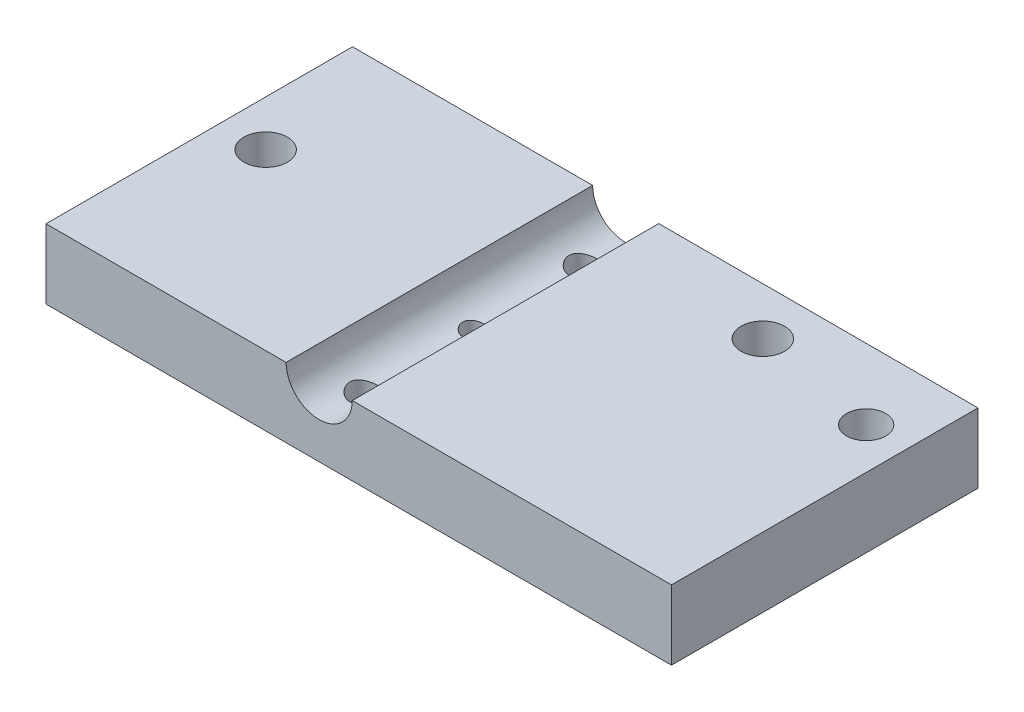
ISO-10303-21;
HEADER;
FILE_DESCRIPTION(('STEP AP214'),'2;1');
FILE_NAME('part.step','',(''),(''),'','','');
FILE_SCHEMA(('AUTOMOTIVE_DESIGN { 1 0 10303 214 1 1 1 1 }'));
ENDSEC;
DATA;
#1=APPLICATION_CONTEXT('core data for automotive mechanical design processes');
#2=APPLICATION_PROTOCOL_DEFINITION('international standard','automotive_design',2000,#1);
#3=PRODUCT_CONTEXT('',#1,'mechanical');
#4=PRODUCT('Part','Part','',(#3));
#5=PRODUCT_RELATED_PRODUCT_CATEGORY('part','',(#4));
#6=PRODUCT_DEFINITION_FORMATION('','',#4);
#7=PRODUCT_DEFINITION_CONTEXT('part definition',#1,'design');
#8=PRODUCT_DEFINITION('design','',#6,#7);
#9=PRODUCT_DEFINITION_SHAPE('','',#8);
#10=(LENGTH_UNIT() NAMED_UNIT(*) SI_UNIT(.MILLI.,.METRE.));
#11=(NAMED_UNIT(*) PLANE_ANGLE_UNIT() SI_UNIT($,.RADIAN.));
#12=(NAMED_UNIT(*) SI_UNIT($,.STERADIAN.) SOLID_ANGLE_UNIT());
#13=UNCERTAINTY_MEASURE_WITH_UNIT(LENGTH_MEASURE(1.E-05),#10,'distance_accuracy_value','');
#14=(GEOMETRIC_REPRESENTATION_CONTEXT(3) GLOBAL_UNCERTAINTY_ASSIGNED_CONTEXT((#13)) GLOBAL_UNIT_ASSIGNED_CONTEXT((#10,
#11,#12)) REPRESENTATION_CONTEXT('',''));
#15=CARTESIAN_POINT('',(0.,0.,0.));
#16=DIRECTION('',(0.,0.,1.));
#17=DIRECTION('',(1.,0.,0.));
#18=AXIS2_PLACEMENT_3D('',#15,#16,#17);
#19=CARTESIAN_POINT('',(-71.9,8.,70.47));
#20=DIRECTION('',(0.,-1.,0.));
#21=DIRECTION('',(0.,0.,-1.));
#22=AXIS2_PLACEMENT_3D('',#19,#20,#21);
#23=PLANE('',#22);
#24=CARTESIAN_POINT('',(33.4,8.,10.97));
#25=DIRECTION('',(0.,1.,0.));
#26=DIRECTION('',(0.,0.,1.));
#27=AXIS2_PLACEMENT_3D('',#24,#25,#26);
#28=CIRCLE('',#27,5.);
#29=CARTESIAN_POINT('',(33.4,8.,15.97));
#30=VERTEX_POINT('',#29);
#31=EDGE_CURVE('E191',#30,#30,#28,.T.);
#32=ORIENTED_EDGE('',*,*,#31,.F.);
#33=EDGE_LOOP('',(#32));
#34=FACE_BOUND('',#33,.T.);
#35=CARTESIAN_POINT('',(62.4,8.,16.21));
#36=DIRECTION('',(0.,1.,0.));
#37=DIRECTION('',(0.,0.,1.));
#38=AXIS2_PLACEMENT_3D('',#35,#36,#37);
#39=CIRCLE('',#38,4.5);
#40=CARTESIAN_POINT('',(62.4,8.,20.71));
#41=VERTEX_POINT('',#40);
#42=EDGE_CURVE('E194',#41,#41,#39,.T.);
#43=ORIENTED_EDGE('',*,*,#42,.F.);
#44=EDGE_LOOP('',(#43));
#45=FACE_BOUND('',#44,.T.);
#46=DIRECTION('',(-1.,0.,0.));
#47=VECTOR('',#46,1.);
#48=CARTESIAN_POINT('',(-71.9,8.,0.));
#49=LINE('',#48,#47);
#50=CARTESIAN_POINT('',(71.9,8.,0.));
#51=VERTEX_POINT('',#50);
#52=CARTESIAN_POINT('',(-1.49999999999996,8.,0.));
#53=VERTEX_POINT('',#52);
#54=EDGE_CURVE('E122',#51,#53,#49,.T.);
#55=ORIENTED_EDGE('',*,*,#54,.T.);
#56=DIRECTION('',(0.,0.,1.));
#57=VECTOR('',#56,1.);
#58=CARTESIAN_POINT('',(-1.49999999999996,8.,0.));
#59=LINE('',#58,#57);
#60=CARTESIAN_POINT('',(-1.49999999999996,8.,70.47));
#61=VERTEX_POINT('',#60);
#62=EDGE_CURVE('E55',#53,#61,#59,.T.);
#63=ORIENTED_EDGE('',*,*,#62,.T.);
#64=DIRECTION('',(-1.,0.,0.));
#65=VECTOR('',#64,1.);
#66=CARTESIAN_POINT('',(-71.9,8.,70.47));
#67=LINE('',#66,#65);
#68=CARTESIAN_POINT('',(71.9,8.,70.47));
#69=VERTEX_POINT('',#68);
#70=EDGE_CURVE('E91',#69,#61,#67,.T.);
#71=ORIENTED_EDGE('',*,*,#70,.F.);
#72=DIRECTION('',(0.,0.,-1.));
#73=VECTOR('',#72,1.);
#74=CARTESIAN_POINT('',(71.9,8.,70.47));
#75=LINE('',#74,#73);
#76=EDGE_CURVE('E11',#69,#51,#75,.T.);
#77=ORIENTED_EDGE('',*,*,#76,.T.);
#78=EDGE_LOOP('',(#55,#63,#71,#77));
#79=FACE_BOUND('',#78,.T.);
#80=ADVANCED_FACE('F34',(#34,#45,#79),#23,.F.);
#81=CARTESIAN_POINT('',(71.9,8.,70.47));
#82=DIRECTION('',(-1.,0.,0.));
#83=DIRECTION('',(0.,-1.,0.));
#84=AXIS2_PLACEMENT_3D('',#81,#82,#83);
#85=PLANE('',#84);
#86=DIRECTION('',(0.,1.,0.));
#87=VECTOR('',#86,1.);
#88=CARTESIAN_POINT('',(71.9,8.,0.));
#89=LINE('',#88,#87);
#90=CARTESIAN_POINT('',(71.9,-8.,0.));
#91=VERTEX_POINT('',#90);
#92=EDGE_CURVE('E123',#91,#51,#89,.T.);
#93=ORIENTED_EDGE('',*,*,#92,.T.);
#94=ORIENTED_EDGE('',*,*,#76,.F.);
#95=DIRECTION('',(0.,1.,0.));
#96=VECTOR('',#95,1.);
#97=CARTESIAN_POINT('',(71.9,8.,70.47));
#98=LINE('',#97,#96);
#99=CARTESIAN_POINT('',(71.9,-8.,70.47));
#100=VERTEX_POINT('',#99);
#101=EDGE_CURVE('E132',#100,#69,#98,.T.);
#102=ORIENTED_EDGE('',*,*,#101,.F.);
#103=DIRECTION('',(0.,0.,-1.));
#104=VECTOR('',#103,1.);
#105=CARTESIAN_POINT('',(71.9,-8.,70.47));
#106=LINE('',#105,#104);
#107=EDGE_CURVE('E133',#100,#91,#106,.T.);
#108=ORIENTED_EDGE('',*,*,#107,.T.);
#109=EDGE_LOOP('',(#93,#94,#102,#108));
#110=FACE_BOUND('',#109,.T.);
#111=ADVANCED_FACE('F36',(#110),#85,.F.);
#112=CARTESIAN_POINT('',(-61.4,8.,30.47));
#113=DIRECTION('',(0.,1.,0.));
#114=DIRECTION('',(0.,0.,1.));
#115=AXIS2_PLACEMENT_3D('',#112,#113,#114);
#116=CIRCLE('',#115,5.);
#117=CARTESIAN_POINT('',(-61.4,8.,35.47));
#118=VERTEX_POINT('',#117);
#119=EDGE_CURVE('E314',#118,#118,#116,.T.);
#120=ORIENTED_EDGE('',*,*,#119,.F.);
#121=EDGE_LOOP('',(#120));
#122=FACE_BOUND('',#121,.T.);
#123=CARTESIAN_POINT('',(-16.7,8.,70.47));
#124=VERTEX_POINT('',#123);
#125=CARTESIAN_POINT('',(-71.9,8.,70.47));
#126=VERTEX_POINT('',#125);
#127=EDGE_CURVE('E116',#124,#126,#67,.T.);
#128=ORIENTED_EDGE('',*,*,#127,.F.);
#129=DIRECTION('',(0.,0.,1.));
#130=VECTOR('',#129,1.);
#131=CARTESIAN_POINT('',(-16.7,8.,0.));
#132=LINE('',#131,#130);
#133=CARTESIAN_POINT('',(-16.7,8.,0.));
#134=VERTEX_POINT('',#133);
#135=EDGE_CURVE('E102',#124,#134,#132,.F.);
#136=ORIENTED_EDGE('',*,*,#135,.T.);
#137=CARTESIAN_POINT('',(-71.9,8.,0.));
#138=VERTEX_POINT('',#137);
#139=EDGE_CURVE('E114',#134,#138,#49,.T.);
#140=ORIENTED_EDGE('',*,*,#139,.T.);
#141=DIRECTION('',(0.,0.,-1.));
#142=VECTOR('',#141,1.);
#143=CARTESIAN_POINT('',(-71.9,8.,70.47));
#144=LINE('',#143,#142);
#145=EDGE_CURVE('E47',#126,#138,#144,.T.);
#146=ORIENTED_EDGE('',*,*,#145,.F.);
#147=EDGE_LOOP('',(#128,#136,#140,#146));
#148=FACE_BOUND('',#147,.T.);
#149=ADVANCED_FACE('F112',(#122,#148),#23,.F.);
#150=CARTESIAN_POINT('',(-71.9,8.,70.47));
#151=DIRECTION('',(1.,0.,0.));
#152=DIRECTION('',(0.,0.,-1.));
#153=AXIS2_PLACEMENT_3D('',#150,#151,#152);
#154=PLANE('',#153);
#155=DIRECTION('',(0.,-1.,0.));
#156=VECTOR('',#155,1.);
#157=CARTESIAN_POINT('',(-71.9,8.,0.));
#158=LINE('',#157,#156);
#159=CARTESIAN_POINT('',(-71.9,-8.,0.));
#160=VERTEX_POINT('',#159);
#161=EDGE_CURVE('E121',#138,#160,#158,.T.);
#162=ORIENTED_EDGE('',*,*,#161,.T.);
#163=DIRECTION('',(0.,0.,-1.));
#164=VECTOR('',#163,1.);
#165=CARTESIAN_POINT('',(-71.9,-8.,70.47));
#166=LINE('',#165,#164);
#167=CARTESIAN_POINT('',(-71.9,-8.,70.47));
#168=VERTEX_POINT('',#167);
#169=EDGE_CURVE('E135',#168,#160,#166,.T.);
#170=ORIENTED_EDGE('',*,*,#169,.F.);
#171=DIRECTION('',(0.,-1.,0.));
#172=VECTOR('',#171,1.);
#173=CARTESIAN_POINT('',(-71.9,8.,70.47));
#174=LINE('',#173,#172);
#175=EDGE_CURVE('E199',#126,#168,#174,.T.);
#176=ORIENTED_EDGE('',*,*,#175,.F.);
#177=ORIENTED_EDGE('',*,*,#145,.T.);
#178=EDGE_LOOP('',(#162,#170,#176,#177));
#179=FACE_BOUND('',#178,.T.);
#180=ADVANCED_FACE('F171',(#179),#154,.F.);
#181=CARTESIAN_POINT('',(-71.9,-8.,70.47));
#182=DIRECTION('',(0.,1.,0.));
#183=DIRECTION('',(0.,0.,1.));
#184=AXIS2_PLACEMENT_3D('',#181,#182,#183);
#185=PLANE('',#184);
#186=CARTESIAN_POINT('',(33.4,-8.,10.97));
#187=DIRECTION('',(0.,1.,0.));
#188=DIRECTION('',(0.,0.,1.));
#189=AXIS2_PLACEMENT_3D('',#186,#187,#188);
#190=CIRCLE('',#189,5.);
#191=CARTESIAN_POINT('',(33.4,-8.,15.97));
#192=VERTEX_POINT('',#191);
#193=EDGE_CURVE('E312',#192,#192,#190,.T.);
#194=ORIENTED_EDGE('',*,*,#193,.T.);
#195=EDGE_LOOP('',(#194));
#196=FACE_BOUND('',#195,.T.);
#197=CARTESIAN_POINT('',(-61.4,-8.,30.47));
#198=DIRECTION('',(0.,1.,0.));
#199=DIRECTION('',(0.,0.,1.));
#200=AXIS2_PLACEMENT_3D('',#197,#198,#199);
#201=CIRCLE('',#200,5.);
#202=CARTESIAN_POINT('',(-61.4,-8.,35.47));
#203=VERTEX_POINT('',#202);
#204=EDGE_CURVE('E317',#203,#203,#201,.T.);
#205=ORIENTED_EDGE('',*,*,#204,.T.);
#206=EDGE_LOOP('',(#205));
#207=FACE_BOUND('',#206,.T.);
#208=CARTESIAN_POINT('',(62.4,-8.,16.21));
#209=DIRECTION('',(0.,1.,0.));
#210=DIRECTION('',(0.,0.,1.));
#211=AXIS2_PLACEMENT_3D('',#208,#209,#210);
#212=CIRCLE('',#211,3.86576453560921);
#213=CARTESIAN_POINT('',(62.4,-8.,20.0757645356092));
#214=VERTEX_POINT('',#213);
#215=EDGE_CURVE('E323',#214,#214,#212,.T.);
#216=ORIENTED_EDGE('',*,*,#215,.T.);
#217=EDGE_LOOP('',(#216));
#218=FACE_BOUND('',#217,.T.);
#219=CARTESIAN_POINT('',(-9.09999999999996,-8.,34.97));
#220=DIRECTION('',(0.,1.,0.));
#221=DIRECTION('',(0.,0.,1.));
#222=AXIS2_PLACEMENT_3D('',#219,#220,#221);
#223=CIRCLE('',#222,2.5);
#224=CARTESIAN_POINT('',(-9.09999999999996,-8.,37.47));
#225=VERTEX_POINT('',#224);
#226=EDGE_CURVE('E326',#225,#225,#223,.T.);
#227=ORIENTED_EDGE('',*,*,#226,.T.);
#228=EDGE_LOOP('',(#227));
#229=FACE_BOUND('',#228,.T.);
#230=CARTESIAN_POINT('',(-9.09999999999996,-8.,9.77));
#231=DIRECTION('',(0.,-1.,0.));
#232=DIRECTION('',(0.,0.,-1.));
#233=AXIS2_PLACEMENT_3D('',#230,#231,#232);
#234=CIRCLE('',#233,3.25000000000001);
#235=CARTESIAN_POINT('',(-9.09999999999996,-8.,6.51999999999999));
#236=VERTEX_POINT('',#235);
#237=EDGE_CURVE('E206',#236,#236,#234,.T.);
#238=ORIENTED_EDGE('',*,*,#237,.F.);
#239=EDGE_LOOP('',(#238));
#240=FACE_BOUND('',#239,.T.);
#241=CARTESIAN_POINT('',(-9.09999999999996,-8.,60.17));
#242=DIRECTION('',(0.,-1.,0.));
#243=DIRECTION('',(0.,0.,-1.));
#244=AXIS2_PLACEMENT_3D('',#241,#242,#243);
#245=CIRCLE('',#244,3.25000000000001);
#246=CARTESIAN_POINT('',(-9.09999999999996,-8.,56.92));
#247=VERTEX_POINT('',#246);
#248=EDGE_CURVE('E126',#247,#247,#245,.T.);
#249=ORIENTED_EDGE('',*,*,#248,.F.);
#250=EDGE_LOOP('',(#249));
#251=FACE_BOUND('',#250,.T.);
#252=DIRECTION('',(1.,0.,0.));
#253=VECTOR('',#252,1.);
#254=CARTESIAN_POINT('',(-71.9,-8.,0.));
#255=LINE('',#254,#253);
#256=EDGE_CURVE('E85',#160,#91,#255,.T.);
#257=ORIENTED_EDGE('',*,*,#256,.T.);
#258=ORIENTED_EDGE('',*,*,#107,.F.);
#259=DIRECTION('',(1.,0.,0.));
#260=VECTOR('',#259,1.);
#261=CARTESIAN_POINT('',(-71.9,-8.,70.47));
#262=LINE('',#261,#260);
#263=EDGE_CURVE('E64',#168,#100,#262,.T.);
#264=ORIENTED_EDGE('',*,*,#263,.F.);
#265=ORIENTED_EDGE('',*,*,#169,.T.);
#266=EDGE_LOOP('',(#257,#258,#264,#265));
#267=FACE_BOUND('',#266,.T.);
#268=ADVANCED_FACE('F166',(#196,#207,#218,#229,#240,#251,#267),#185,.F.);
#269=CARTESIAN_POINT('',(0.,0.,70.47));
#270=DIRECTION('',(0.,0.,1.));
#271=DIRECTION('',(1.,0.,0.));
#272=AXIS2_PLACEMENT_3D('',#269,#270,#271);
#273=PLANE('',#272);
#274=CARTESIAN_POINT('',(-9.09999999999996,8.,70.47));
#275=DIRECTION('',(0.,0.,1.));
#276=DIRECTION('',(1.,0.,0.));
#277=AXIS2_PLACEMENT_3D('',#274,#275,#276);
#278=CIRCLE('',#277,7.6);
#279=EDGE_CURVE('E108',#124,#61,#278,.T.);
#280=ORIENTED_EDGE('',*,*,#279,.F.);
#281=ORIENTED_EDGE('',*,*,#127,.T.);
#282=ORIENTED_EDGE('',*,*,#175,.T.);
#283=ORIENTED_EDGE('',*,*,#263,.T.);
#284=ORIENTED_EDGE('',*,*,#101,.T.);
#285=ORIENTED_EDGE('',*,*,#70,.T.);
#286=EDGE_LOOP('',(#280,#281,#282,#283,#284,#285));
#287=FACE_BOUND('',#286,.T.);
#288=ADVANCED_FACE('F163',(#287),#273,.T.);
#289=CARTESIAN_POINT('',(0.,0.,0.));
#290=DIRECTION('',(0.,0.,1.));
#291=DIRECTION('',(1.,0.,0.));
#292=AXIS2_PLACEMENT_3D('',#289,#290,#291);
#293=PLANE('',#292);
#294=ORIENTED_EDGE('',*,*,#139,.F.);
#295=CARTESIAN_POINT('',(-9.09999999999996,8.,0.));
#296=DIRECTION('',(0.,0.,1.));
#297=DIRECTION('',(1.,0.,0.));
#298=AXIS2_PLACEMENT_3D('',#295,#296,#297);
#299=CIRCLE('',#298,7.6);
#300=EDGE_CURVE('E99',#134,#53,#299,.T.);
#301=ORIENTED_EDGE('',*,*,#300,.T.);
#302=ORIENTED_EDGE('',*,*,#54,.F.);
#303=ORIENTED_EDGE('',*,*,#92,.F.);
#304=ORIENTED_EDGE('',*,*,#256,.F.);
#305=ORIENTED_EDGE('',*,*,#161,.F.);
#306=EDGE_LOOP('',(#294,#301,#302,#303,#304,#305));
#307=FACE_BOUND('',#306,.T.);
#308=ADVANCED_FACE('F120',(#307),#293,.F.);
#309=CARTESIAN_POINT('',(-9.09999999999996,8.,60.17));
#310=DIRECTION('',(0.,-1.,0.));
#311=DIRECTION('',(0.,0.,-1.));
#312=AXIS2_PLACEMENT_3D('',#309,#310,#311);
#313=CYLINDRICAL_SURFACE('',#312,3.25000000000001);
#314=CARTESIAN_POINT('',(-9.09999999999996,0.400000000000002,56.92));
#315=CARTESIAN_POINT('',(-9.18688160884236,0.400000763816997,56.9200010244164));
#316=CARTESIAN_POINT('',(-9.27379384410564,0.401495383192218,56.9234909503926));
#317=CARTESIAN_POINT('',(-9.44697556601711,0.407428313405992,56.9374042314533));
#318=CARTESIAN_POINT('',(-9.5332446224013,0.411868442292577,56.9478318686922));
#319=CARTESIAN_POINT('',(-9.79044511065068,0.429484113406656,56.9894489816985));
#320=CARTESIAN_POINT('',(-9.95954466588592,0.446954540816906,57.0309723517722));
#321=CARTESIAN_POINT('',(-10.2871235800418,0.491466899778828,57.1396558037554));
#322=CARTESIAN_POINT('',(-10.4456374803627,0.518475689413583,57.2067271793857));
#323=CARTESIAN_POINT('',(-10.7490404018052,0.579447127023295,57.3642257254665));
#324=CARTESIAN_POINT('',(-10.8939331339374,0.613407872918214,57.4546465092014));
#325=CARTESIAN_POINT('',(-11.1737494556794,0.686895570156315,57.6612652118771));
#326=CARTESIAN_POINT('',(-11.3078650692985,0.726611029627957,57.778488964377));
#327=CARTESIAN_POINT('',(-11.5552374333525,0.80634106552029,58.0332138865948));
#328=CARTESIAN_POINT('',(-11.6684826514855,0.84635579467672,58.1707261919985));
#329=CARTESIAN_POINT('',(-11.8767787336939,0.924511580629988,58.470859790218));
#330=CARTESIAN_POINT('',(-11.9705633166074,0.962444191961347,58.6344199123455));
#331=CARTESIAN_POINT('',(-12.1289290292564,1.02913012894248,58.9768459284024));
#332=CARTESIAN_POINT('',(-12.1935259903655,1.0578884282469,59.155703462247));
#333=CARTESIAN_POINT('',(-12.288303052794,1.10091842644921,59.5143517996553));
#334=CARTESIAN_POINT('',(-12.3200415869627,1.1158421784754,59.6936494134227));
#335=CARTESIAN_POINT('',(-12.3530575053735,1.13137671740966,60.0555983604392));
#336=CARTESIAN_POINT('',(-12.3543530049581,1.13199601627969,60.2382476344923));
#337=CARTESIAN_POINT('',(-12.3276152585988,1.11940049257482,60.5857978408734));
#338=CARTESIAN_POINT('',(-12.3019656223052,1.10730994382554,60.7509312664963));
#339=CARTESIAN_POINT('',(-12.2260800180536,1.07256565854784,61.0742752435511));
#340=CARTESIAN_POINT('',(-12.175839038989,1.04990976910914,61.2324843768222));
#341=CARTESIAN_POINT('',(-12.0512076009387,0.996068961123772,61.5415908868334));
#342=CARTESIAN_POINT('',(-11.9763148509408,0.96470897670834,61.6922538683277));
#343=CARTESIAN_POINT('',(-11.8048630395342,0.897028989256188,61.979480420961));
#344=CARTESIAN_POINT('',(-11.7082951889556,0.860706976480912,62.1160382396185));
#345=CARTESIAN_POINT('',(-11.4860999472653,0.783245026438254,62.3840384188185));
#346=CARTESIAN_POINT('',(-11.3586456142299,0.741964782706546,62.5139299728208));
#347=CARTESIAN_POINT('',(-11.0833767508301,0.661965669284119,62.7510315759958));
#348=CARTESIAN_POINT('',(-10.9355569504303,0.623247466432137,62.8582357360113));
#349=CARTESIAN_POINT('',(-10.6188259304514,0.551499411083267,63.0493612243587));
#350=CARTESIAN_POINT('',(-10.4494731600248,0.518639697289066,63.1326194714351));
#351=CARTESIAN_POINT('',(-10.0973998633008,0.463631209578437,63.2689139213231));
#352=CARTESIAN_POINT('',(-9.91468719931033,0.441476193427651,63.32196774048));
#353=CARTESIAN_POINT('',(-9.55401272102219,0.411558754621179,63.3930268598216));
#354=CARTESIAN_POINT('',(-9.37653125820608,0.40294410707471,63.413111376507));
#355=CARTESIAN_POINT('',(-9.02053782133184,0.398333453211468,63.4239005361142));
#356=CARTESIAN_POINT('',(-8.84202618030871,0.402333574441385,63.414614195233));
#357=CARTESIAN_POINT('',(-8.49899057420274,0.421954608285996,63.3683845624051));
#358=CARTESIAN_POINT('',(-8.33422608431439,0.436949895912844,63.3329295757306));
#359=CARTESIAN_POINT('',(-8.01318219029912,0.47637041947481,63.2374720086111));
#360=CARTESIAN_POINT('',(-7.85690384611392,0.500796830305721,63.1774663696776));
#361=CARTESIAN_POINT('',(-7.55174858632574,0.557703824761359,63.0326619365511));
#362=CARTESIAN_POINT('',(-7.40325506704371,0.590412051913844,62.9471475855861));
#363=CARTESIAN_POINT('',(-7.12219048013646,0.660430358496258,62.7545358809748));
#364=CARTESIAN_POINT('',(-6.98962623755,0.697742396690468,62.6474293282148));
#365=CARTESIAN_POINT('',(-6.73371047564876,0.776433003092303,62.4052819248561));
#366=CARTESIAN_POINT('',(-6.61179763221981,0.817906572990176,62.2687476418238));
#367=CARTESIAN_POINT('',(-6.3921809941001,0.897788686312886,61.9765515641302));
#368=CARTESIAN_POINT('',(-6.29448382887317,0.936196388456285,61.8208845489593));
#369=CARTESIAN_POINT('',(-6.1246884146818,1.00599317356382,61.4909902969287));
#370=CARTESIAN_POINT('',(-6.05307213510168,1.03724649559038,61.3164840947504));
#371=CARTESIAN_POINT('',(-5.94088055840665,1.0874165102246,60.9561247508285));
#372=CARTESIAN_POINT('',(-5.90027781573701,1.10634410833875,60.7702817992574));
#373=CARTESIAN_POINT('',(-5.85406063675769,1.12799379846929,60.4085724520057));
#374=CARTESIAN_POINT('',(-5.84590256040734,1.13189324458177,60.2331004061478));
#375=CARTESIAN_POINT('',(-5.85794194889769,1.12620136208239,59.8833736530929));
#376=CARTESIAN_POINT('',(-5.87813446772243,1.11661238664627,59.709118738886));
#377=CARTESIAN_POINT('',(-5.9441281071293,1.08612432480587,59.3760735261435));
#378=CARTESIAN_POINT('',(-5.98855329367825,1.0658347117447,59.216949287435));
#379=CARTESIAN_POINT('',(-6.10036593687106,1.0167412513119,58.9083968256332));
#380=CARTESIAN_POINT('',(-6.16775991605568,0.987934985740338,58.7589713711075));
#381=CARTESIAN_POINT('',(-6.32838209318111,0.922848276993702,58.463961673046));
#382=CARTESIAN_POINT('',(-6.42294995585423,0.886215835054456,58.3191861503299));
#383=CARTESIAN_POINT('',(-6.63342126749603,0.810529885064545,58.0467626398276));
#384=CARTESIAN_POINT('',(-6.74933273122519,0.77147547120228,57.9191211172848));
#385=CARTESIAN_POINT('',(-7.00994235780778,0.691672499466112,57.6742858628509));
#386=CARTESIAN_POINT('',(-7.15618512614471,0.651031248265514,57.5586963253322));
#387=CARTESIAN_POINT('',(-7.4675754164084,0.575664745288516,57.3535498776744));
#388=CARTESIAN_POINT('',(-7.63273146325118,0.540942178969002,57.2640047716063));
#389=CARTESIAN_POINT('',(-7.88986827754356,0.496462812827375,57.1522706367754));
#390=CARTESIAN_POINT('',(-7.97651892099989,0.482971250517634,57.1189437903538));
#391=CARTESIAN_POINT('',(-8.15268924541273,0.458747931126,57.0597396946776));
#392=CARTESIAN_POINT('',(-8.24220753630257,0.448014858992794,57.0338588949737));
#393=CARTESIAN_POINT('',(-8.4232056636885,0.429649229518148,56.9898887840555));
#394=CARTESIAN_POINT('',(-8.51468013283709,0.422009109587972,56.9717804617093));
#395=CARTESIAN_POINT('',(-8.69901490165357,0.410024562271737,56.9434858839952));
#396=CARTESIAN_POINT('',(-8.79187415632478,0.405677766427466,56.9332939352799));
#397=CARTESIAN_POINT('',(-8.92078604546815,0.402028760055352,56.9247465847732));
#398=CARTESIAN_POINT('',(-8.95659984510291,0.401268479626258,56.9229672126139));
#399=CARTESIAN_POINT('',(-9.02827402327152,0.400253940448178,56.9205937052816));
#400=CARTESIAN_POINT('',(-9.06413440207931,0.3999996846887,56.9199995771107));
#401=CARTESIAN_POINT('',(-9.09999999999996,0.400000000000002,56.92));
#402=B_SPLINE_CURVE_WITH_KNOTS('',3,(#314,#315,#316,#317,#318,#319,#320,#321,#322,#323,#324,
#325,#326,#327,#328,#329,#330,#331,#332,#333,#334,#335,#336,#337,#338,#339,#340,#341,#342,#343,
#344,#345,#346,#347,#348,#349,#350,#351,#352,#353,#354,#355,#356,#357,#358,#359,#360,#361,#362,
#363,#364,#365,#366,#367,#368,#369,#370,#371,#372,#373,#374,#375,#376,#377,#378,#379,#380,#381,
#382,#383,#384,#385,#386,#387,#388,#389,#390,#391,#392,#393,#394,#395,#396,#397,#398,#399,#400,
#401),.UNSPECIFIED.,.T.,.F.,(4,2,2,2,2,2,2,2,2,2,2,2,2,2,2,2,2,2,2,2,2,2,2,2,2,2,2,2,2,2,2,2,2,
2,2,2,2,2,2,2,2,2,2,4),(0.,0.260605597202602,0.521372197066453,1.04357198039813,1.5639749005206,
2.08423562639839,2.62937342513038,3.17481155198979,3.74886605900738,4.3226088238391,
4.86768328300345,5.4124333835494,5.91275039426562,6.41316939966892,6.9244909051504,
7.43602012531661,7.99331582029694,8.5507560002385,9.12240430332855,9.69371885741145,
10.2273853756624,10.7608880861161,11.2661821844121,11.7715392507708,12.2926735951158,
12.8140304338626,13.3745257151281,13.9351742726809,14.5057127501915,15.0757457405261,
15.6000873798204,16.1243375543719,16.6215219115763,17.1188475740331,17.6469222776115,
18.1751956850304,18.7448949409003,19.3148519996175,19.5959811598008,19.8769760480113,
20.1572796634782,20.4373815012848,20.5449614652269,20.6525420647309),.UNSPECIFIED.);
#403=CARTESIAN_POINT('',(-9.09999999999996,0.400000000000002,56.92));
#404=VERTEX_POINT('',#403);
#405=EDGE_CURVE('E117',#404,#404,#402,.T.);
#406=ORIENTED_EDGE('',*,*,#405,.T.);
#407=EDGE_LOOP('',(#406));
#408=FACE_BOUND('',#407,.T.);
#409=ORIENTED_EDGE('',*,*,#248,.T.);
#410=EDGE_LOOP('',(#409));
#411=FACE_BOUND('',#410,.T.);
#412=ADVANCED_FACE('F158',(#408,#411),#313,.F.);
#413=CARTESIAN_POINT('',(-9.09999999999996,8.,9.77));
#414=DIRECTION('',(0.,-1.,0.));
#415=DIRECTION('',(0.,0.,-1.));
#416=AXIS2_PLACEMENT_3D('',#413,#414,#415);
#417=CYLINDRICAL_SURFACE('',#416,3.25000000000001);
#418=CARTESIAN_POINT('',(-9.09999999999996,0.400000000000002,6.51999999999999));
#419=CARTESIAN_POINT('',(-9.18688160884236,0.400000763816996,6.52000102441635));
#420=CARTESIAN_POINT('',(-9.27379384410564,0.401495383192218,6.5234909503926));
#421=CARTESIAN_POINT('',(-9.44697556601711,0.407428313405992,6.53740423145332));
#422=CARTESIAN_POINT('',(-9.53324462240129,0.411868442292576,6.54783186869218));
#423=CARTESIAN_POINT('',(-9.79044511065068,0.429484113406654,6.58944898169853));
#424=CARTESIAN_POINT('',(-9.95954466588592,0.446954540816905,6.6309723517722));
#425=CARTESIAN_POINT('',(-10.2871235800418,0.491466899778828,6.7396558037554));
#426=CARTESIAN_POINT('',(-10.4456374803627,0.518475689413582,6.80672717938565));
#427=CARTESIAN_POINT('',(-10.7490404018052,0.579447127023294,6.96422572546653));
#428=CARTESIAN_POINT('',(-10.8939331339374,0.613407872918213,7.05464650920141));
#429=CARTESIAN_POINT('',(-11.1737494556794,0.686895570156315,7.26126521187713));
#430=CARTESIAN_POINT('',(-11.3078650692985,0.726611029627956,7.37848896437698));
#431=CARTESIAN_POINT('',(-11.5552374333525,0.806341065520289,7.6332138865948));
#432=CARTESIAN_POINT('',(-11.6684826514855,0.846355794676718,7.77072619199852));
#433=CARTESIAN_POINT('',(-11.8767787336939,0.924511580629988,8.07085979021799));
#434=CARTESIAN_POINT('',(-11.9705633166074,0.962444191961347,8.23441991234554));
#435=CARTESIAN_POINT('',(-12.1289290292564,1.02913012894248,8.57684592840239));
#436=CARTESIAN_POINT('',(-12.1935259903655,1.0578884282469,8.75570346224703));
#437=CARTESIAN_POINT('',(-12.288303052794,1.10091842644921,9.1143517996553));
#438=CARTESIAN_POINT('',(-12.3200415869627,1.1158421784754,9.29364941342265));
#439=CARTESIAN_POINT('',(-12.3530575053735,1.13137671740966,9.65559836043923));
#440=CARTESIAN_POINT('',(-12.3543530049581,1.13199601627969,9.83824763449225));
#441=CARTESIAN_POINT('',(-12.3276152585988,1.11940049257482,10.1857978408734));
#442=CARTESIAN_POINT('',(-12.3019656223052,1.10730994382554,10.3509312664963));
#443=CARTESIAN_POINT('',(-12.2260800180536,1.07256565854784,10.6742752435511));
#444=CARTESIAN_POINT('',(-12.175839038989,1.04990976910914,10.8324843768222));
#445=CARTESIAN_POINT('',(-12.0512076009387,0.996068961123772,11.1415908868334));
#446=CARTESIAN_POINT('',(-11.9763148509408,0.964708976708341,11.2922538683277));
#447=CARTESIAN_POINT('',(-11.8048630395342,0.897028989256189,11.579480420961));
#448=CARTESIAN_POINT('',(-11.7082951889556,0.860706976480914,11.7160382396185));
#449=CARTESIAN_POINT('',(-11.4860999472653,0.783245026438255,11.9840384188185));
#450=CARTESIAN_POINT('',(-11.3586456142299,0.741964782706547,12.1139299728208));
#451=CARTESIAN_POINT('',(-11.0833767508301,0.66196566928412,12.3510315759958));
#452=CARTESIAN_POINT('',(-10.9355569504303,0.623247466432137,12.4582357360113));
#453=CARTESIAN_POINT('',(-10.6188259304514,0.551499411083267,12.6493612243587));
#454=CARTESIAN_POINT('',(-10.4494731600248,0.518639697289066,12.7326194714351));
#455=CARTESIAN_POINT('',(-10.0973998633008,0.463631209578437,12.8689139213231));
#456=CARTESIAN_POINT('',(-9.91468719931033,0.441476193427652,12.92196774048));
#457=CARTESIAN_POINT('',(-9.55401272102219,0.411558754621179,12.9930268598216));
#458=CARTESIAN_POINT('',(-9.37653125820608,0.40294410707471,13.013111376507));
#459=CARTESIAN_POINT('',(-9.02053782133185,0.398333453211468,13.0239005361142));
#460=CARTESIAN_POINT('',(-8.84202618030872,0.402333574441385,13.014614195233));
#461=CARTESIAN_POINT('',(-8.49899057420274,0.421954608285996,12.9683845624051));
#462=CARTESIAN_POINT('',(-8.33422608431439,0.436949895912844,12.9329295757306));
#463=CARTESIAN_POINT('',(-8.01318219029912,0.476370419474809,12.8374720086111));
#464=CARTESIAN_POINT('',(-7.85690384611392,0.500796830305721,12.7774663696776));
#465=CARTESIAN_POINT('',(-7.55174858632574,0.557703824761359,12.6326619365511));
#466=CARTESIAN_POINT('',(-7.40325506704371,0.590412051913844,12.5471475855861));
#467=CARTESIAN_POINT('',(-7.12219048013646,0.660430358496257,12.3545358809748));
#468=CARTESIAN_POINT('',(-6.98962623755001,0.697742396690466,12.2474293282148));
#469=CARTESIAN_POINT('',(-6.73371047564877,0.776433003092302,12.0052819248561));
#470=CARTESIAN_POINT('',(-6.61179763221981,0.817906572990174,11.8687476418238));
#471=CARTESIAN_POINT('',(-6.3921809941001,0.897788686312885,11.5765515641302));
#472=CARTESIAN_POINT('',(-6.29448382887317,0.936196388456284,11.4208845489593));
#473=CARTESIAN_POINT('',(-6.1246884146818,1.00599317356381,11.0909902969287));
#474=CARTESIAN_POINT('',(-6.05307213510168,1.03724649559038,10.9164840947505));
#475=CARTESIAN_POINT('',(-5.94088055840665,1.0874165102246,10.5561247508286));
#476=CARTESIAN_POINT('',(-5.90027781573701,1.10634410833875,10.3702817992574));
#477=CARTESIAN_POINT('',(-5.85406063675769,1.12799379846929,10.0085724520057));
#478=CARTESIAN_POINT('',(-5.84590256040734,1.13189324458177,9.83310040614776));
#479=CARTESIAN_POINT('',(-5.85794194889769,1.12620136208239,9.48337365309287));
#480=CARTESIAN_POINT('',(-5.87813446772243,1.11661238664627,9.30911873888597));
#481=CARTESIAN_POINT('',(-5.9441281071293,1.08612432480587,8.97607352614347));
#482=CARTESIAN_POINT('',(-5.98855329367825,1.06583471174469,8.81694928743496));
#483=CARTESIAN_POINT('',(-6.10036593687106,1.0167412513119,8.50839682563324));
#484=CARTESIAN_POINT('',(-6.16775991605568,0.987934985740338,8.35897137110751));
#485=CARTESIAN_POINT('',(-6.32838209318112,0.922848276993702,8.06396167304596));
#486=CARTESIAN_POINT('',(-6.42294995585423,0.886215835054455,7.91918615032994));
#487=CARTESIAN_POINT('',(-6.63342126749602,0.810529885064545,7.64676263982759));
#488=CARTESIAN_POINT('',(-6.74933273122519,0.771475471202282,7.51912111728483));
#489=CARTESIAN_POINT('',(-7.00994235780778,0.691672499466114,7.27428586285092));
#490=CARTESIAN_POINT('',(-7.15618512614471,0.651031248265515,7.15869632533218));
#491=CARTESIAN_POINT('',(-7.4675754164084,0.575664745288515,6.95354987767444));
#492=CARTESIAN_POINT('',(-7.63273146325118,0.540942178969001,6.86400477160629));
#493=CARTESIAN_POINT('',(-7.88986827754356,0.496462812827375,6.75227063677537));
#494=CARTESIAN_POINT('',(-7.97651892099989,0.482971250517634,6.71894379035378));
#495=CARTESIAN_POINT('',(-8.15268924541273,0.458747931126,6.65973969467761));
#496=CARTESIAN_POINT('',(-8.24220753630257,0.448014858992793,6.6338588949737));
#497=CARTESIAN_POINT('',(-8.42320566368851,0.429649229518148,6.58988878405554));
#498=CARTESIAN_POINT('',(-8.5146801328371,0.422009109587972,6.57178046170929));
#499=CARTESIAN_POINT('',(-8.69901490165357,0.410024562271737,6.54348588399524));
#500=CARTESIAN_POINT('',(-8.79187415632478,0.405677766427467,6.53329393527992));
#501=CARTESIAN_POINT('',(-8.92078604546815,0.402028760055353,6.52474658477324));
#502=CARTESIAN_POINT('',(-8.95659984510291,0.401268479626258,6.52296721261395));
#503=CARTESIAN_POINT('',(-9.02827402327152,0.400253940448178,6.52059370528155));
#504=CARTESIAN_POINT('',(-9.06413440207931,0.3999996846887,6.51999957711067));
#505=CARTESIAN_POINT('',(-9.09999999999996,0.400000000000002,6.51999999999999));
#506=B_SPLINE_CURVE_WITH_KNOTS('',3,(#418,#419,#420,#421,#422,#423,#424,#425,#426,#427,#428,
#429,#430,#431,#432,#433,#434,#435,#436,#437,#438,#439,#440,#441,#442,#443,#444,#445,#446,#447,
#448,#449,#450,#451,#452,#453,#454,#455,#456,#457,#458,#459,#460,#461,#462,#463,#464,#465,#466,
#467,#468,#469,#470,#471,#472,#473,#474,#475,#476,#477,#478,#479,#480,#481,#482,#483,#484,#485,
#486,#487,#488,#489,#490,#491,#492,#493,#494,#495,#496,#497,#498,#499,#500,#501,#502,#503,#504,
#505),.UNSPECIFIED.,.T.,.F.,(4,2,2,2,2,2,2,2,2,2,2,2,2,2,2,2,2,2,2,2,2,2,2,2,2,2,2,2,2,2,2,2,2,
2,2,2,2,2,2,2,2,2,2,4),(0.,0.2606055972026,0.521372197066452,1.04357198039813,1.5639749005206,
2.08423562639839,2.62937342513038,3.17481155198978,3.74886605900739,4.3226088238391,
4.86768328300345,5.41243338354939,5.91275039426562,6.41316939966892,6.9244909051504,
7.4360201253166,7.99331582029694,8.5507560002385,9.12240430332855,9.69371885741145,
10.2273853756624,10.7608880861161,11.2661821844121,11.7715392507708,12.2926735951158,
12.8140304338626,13.3745257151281,13.9351742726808,14.5057127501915,15.0757457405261,
15.6000873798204,16.1243375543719,16.6215219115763,17.1188475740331,17.6469222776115,
18.1751956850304,18.7448949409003,19.3148519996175,19.5959811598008,19.8769760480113,
20.1572796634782,20.4373815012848,20.5449614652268,20.6525420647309),.UNSPECIFIED.);
#507=CARTESIAN_POINT('',(-9.09999999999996,0.400000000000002,6.51999999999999));
#508=VERTEX_POINT('',#507);
#509=EDGE_CURVE('E107',#508,#508,#506,.T.);
#510=ORIENTED_EDGE('',*,*,#509,.T.);
#511=EDGE_LOOP('',(#510));
#512=FACE_BOUND('',#511,.T.);
#513=ORIENTED_EDGE('',*,*,#237,.T.);
#514=EDGE_LOOP('',(#513));
#515=FACE_BOUND('',#514,.T.);
#516=ADVANCED_FACE('F141',(#512,#515),#417,.F.);
#517=CARTESIAN_POINT('',(-9.09999999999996,8.,0.));
#518=DIRECTION('',(0.,0.,1.));
#519=DIRECTION('',(1.,0.,0.));
#520=AXIS2_PLACEMENT_3D('',#517,#518,#519);
#521=CYLINDRICAL_SURFACE('',#520,7.6);
#522=CARTESIAN_POINT('',(-9.09999999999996,0.400000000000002,37.47));
#523=CARTESIAN_POINT('',(-9.23650951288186,0.399999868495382,37.4700002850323));
#524=CARTESIAN_POINT('',(-9.37301805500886,0.403712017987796,37.4587826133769));
#525=CARTESIAN_POINT('',(-9.64202044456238,0.418155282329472,37.4143413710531));
#526=CARTESIAN_POINT('',(-9.77451376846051,0.428887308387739,37.38111494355));
#527=CARTESIAN_POINT('',(-10.0315685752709,0.456202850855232,37.2939140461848));
#528=CARTESIAN_POINT('',(-10.1561427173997,0.472776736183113,37.2399737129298));
#529=CARTESIAN_POINT('',(-10.3944766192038,0.510080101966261,37.113028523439));
#530=CARTESIAN_POINT('',(-10.508234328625,0.53081036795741,37.0400200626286));
#531=CARTESIAN_POINT('',(-10.725555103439,0.575025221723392,36.8744155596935));
#532=CARTESIAN_POINT('',(-10.8287014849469,0.598574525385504,36.781290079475));
#533=CARTESIAN_POINT('',(-11.0182292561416,0.645413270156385,36.5792210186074));
#534=CARTESIAN_POINT('',(-11.1046070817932,0.668702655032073,36.4702740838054));
#535=CARTESIAN_POINT('',(-11.2604984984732,0.713092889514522,36.2359345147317));
#536=CARTESIAN_POINT('',(-11.3294749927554,0.734114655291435,36.1101681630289));
#537=CARTESIAN_POINT('',(-11.4451210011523,0.770607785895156,35.848017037));
#538=CARTESIAN_POINT('',(-11.491797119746,0.786080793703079,35.711635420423));
#539=CARTESIAN_POINT('',(-11.5599625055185,0.809044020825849,35.4368558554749));
#540=CARTESIAN_POINT('',(-11.5822309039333,0.816780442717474,35.2986723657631));
#541=CARTESIAN_POINT('',(-11.6033840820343,0.824123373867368,35.0203305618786));
#542=CARTESIAN_POINT('',(-11.6022758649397,0.823732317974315,34.8801728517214));
#543=CARTESIAN_POINT('',(-11.5773131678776,0.815080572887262,34.6084623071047));
#544=CARTESIAN_POINT('',(-11.5544696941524,0.807169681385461,34.4768035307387));
#545=CARTESIAN_POINT('',(-11.4883320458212,0.784941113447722,34.2193028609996));
#546=CARTESIAN_POINT('',(-11.4450354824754,0.770622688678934,34.0934616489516));
#547=CARTESIAN_POINT('',(-11.3385477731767,0.73693911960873,33.8488474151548));
#548=CARTESIAN_POINT('',(-11.2750532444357,0.717497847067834,33.7302174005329));
#549=CARTESIAN_POINT('',(-11.1301826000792,0.675791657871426,33.5049736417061));
#550=CARTESIAN_POINT('',(-11.0488014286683,0.653525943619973,33.3983633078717));
#551=CARTESIAN_POINT('',(-10.8655892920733,0.60729763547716,33.1944965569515));
#552=CARTESIAN_POINT('',(-10.7629300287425,0.583306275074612,33.0979895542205));
#553=CARTESIAN_POINT('',(-10.5425884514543,0.537320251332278,32.9233684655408));
#554=CARTESIAN_POINT('',(-10.4249047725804,0.515325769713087,32.8452560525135));
#555=CARTESIAN_POINT('',(-10.1762968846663,0.475535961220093,32.709059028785));
#556=CARTESIAN_POINT('',(-10.0452581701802,0.457782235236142,32.6511704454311));
#557=CARTESIAN_POINT('',(-9.77457969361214,0.428775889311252,32.5584886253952));
#558=CARTESIAN_POINT('',(-9.63494285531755,0.417521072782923,32.5236875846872));
#559=CARTESIAN_POINT('',(-9.3573798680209,0.403142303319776,32.4794853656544));
#560=CARTESIAN_POINT('',(-9.21963161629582,0.399694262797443,32.4690711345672));
#561=CARTESIAN_POINT('',(-8.94433137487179,0.400348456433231,32.4710587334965));
#562=CARTESIAN_POINT('',(-8.80677935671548,0.404449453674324,32.4834568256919));
#563=CARTESIAN_POINT('',(-8.5397990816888,0.419527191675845,32.5299128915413));
#564=CARTESIAN_POINT('',(-8.41025117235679,0.430307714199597,32.5633531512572));
#565=CARTESIAN_POINT('',(-8.15865306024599,0.457461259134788,32.6501760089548));
#566=CARTESIAN_POINT('',(-8.03660381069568,0.473834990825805,32.7035611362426));
#567=CARTESIAN_POINT('',(-7.79994339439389,0.511035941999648,32.830295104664));
#568=CARTESIAN_POINT('',(-7.68560697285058,0.531967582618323,32.9041254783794));
#569=CARTESIAN_POINT('',(-7.47061441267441,0.575906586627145,33.0690859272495));
#570=CARTESIAN_POINT('',(-7.36996236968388,0.598914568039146,33.160221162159));
#571=CARTESIAN_POINT('',(-7.18056998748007,0.645699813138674,33.3619694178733));
#572=CARTESIAN_POINT('',(-7.09255244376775,0.669466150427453,33.4732651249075));
#573=CARTESIAN_POINT('',(-6.93635898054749,0.714035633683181,33.7095587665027));
#574=CARTESIAN_POINT('',(-6.86818310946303,0.734838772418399,33.8345567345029));
#575=CARTESIAN_POINT('',(-6.75395091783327,0.77091605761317,34.0946863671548));
#576=CARTESIAN_POINT('',(-6.70783990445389,0.786203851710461,34.2297920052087));
#577=CARTESIAN_POINT('',(-6.63922210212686,0.80931792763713,34.5064668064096));
#578=CARTESIAN_POINT('',(-6.61670504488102,0.817147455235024,34.6480331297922));
#579=CARTESIAN_POINT('',(-6.59670196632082,0.824095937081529,34.9259876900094));
#580=CARTESIAN_POINT('',(-6.59801933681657,0.82363131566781,35.0622803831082));
#581=CARTESIAN_POINT('',(-6.62271486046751,0.815069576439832,35.3325954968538));
#582=CARTESIAN_POINT('',(-6.64609176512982,0.806972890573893,35.466618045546));
#583=CARTESIAN_POINT('',(-6.71340530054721,0.784365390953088,35.7261935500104));
#584=CARTESIAN_POINT('',(-6.75696417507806,0.769972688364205,35.8518555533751));
#585=CARTESIAN_POINT('',(-6.86310114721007,0.736435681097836,36.0941849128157));
#586=CARTESIAN_POINT('',(-6.92568339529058,0.71729033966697,36.210850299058));
#587=CARTESIAN_POINT('',(-7.07120934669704,0.675386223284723,36.4372710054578));
#588=CARTESIAN_POINT('',(-7.15490816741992,0.652508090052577,36.5465187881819));
#589=CARTESIAN_POINT('',(-7.33900364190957,0.606226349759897,36.7498051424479));
#590=CARTESIAN_POINT('',(-7.43940496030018,0.582822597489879,36.8438394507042));
#591=CARTESIAN_POINT('',(-7.65858775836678,0.537071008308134,37.0175859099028));
#592=CARTESIAN_POINT('',(-7.77791813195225,0.514795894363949,37.096627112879));
#593=CARTESIAN_POINT('',(-8.02889767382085,0.474785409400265,37.2334377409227));
#594=CARTESIAN_POINT('',(-8.16054330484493,0.457048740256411,37.2912132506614));
#595=CARTESIAN_POINT('',(-8.42519072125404,0.428911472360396,37.3810382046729));
#596=CARTESIAN_POINT('',(-8.55774643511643,0.418170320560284,37.4142944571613));
#597=CARTESIAN_POINT('',(-8.82686912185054,0.403715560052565,37.4587723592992));
#598=CARTESIAN_POINT('',(-8.96343504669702,0.40000013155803,37.4699997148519));
#599=CARTESIAN_POINT('',(-9.09999999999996,0.400000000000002,37.47));
#600=B_SPLINE_CURVE_WITH_KNOTS('',3,(#522,#523,#524,#525,#526,#527,#528,#529,#530,#531,#532,
#533,#534,#535,#536,#537,#538,#539,#540,#541,#542,#543,#544,#545,#546,#547,#548,#549,#550,#551,
#552,#553,#554,#555,#556,#557,#558,#559,#560,#561,#562,#563,#564,#565,#566,#567,#568,#569,#570,
#571,#572,#573,#574,#575,#576,#577,#578,#579,#580,#581,#582,#583,#584,#585,#586,#587,#588,#589,
#590,#591,#592,#593,#594,#595,#596,#597,#598,#599),.UNSPECIFIED.,.T.,.F.,(4,2,2,2,2,2,2,2,2,2,2,
2,2,2,2,2,2,2,2,2,2,2,2,2,2,2,2,2,2,2,2,2,2,2,2,2,2,2,4),(0.,0.409026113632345,
0.818105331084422,1.22651325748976,1.63499844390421,2.05594061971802,2.47697216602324,
2.90973781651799,3.34237521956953,3.76075916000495,4.17901776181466,4.57872605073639,
4.97848103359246,5.38454905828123,5.79073200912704,6.21753119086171,6.6443691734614,
7.07523658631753,7.50595828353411,7.91844304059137,8.3308602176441,8.73170172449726,
9.1325940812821,9.54387616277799,9.95528106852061,10.3848633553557,10.8144466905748,
11.2429596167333,11.6712859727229,12.0781706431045,12.4850322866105,12.8845683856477,
13.2841917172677,13.7008733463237,14.1176715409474,14.5501314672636,14.9824675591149,
15.3917658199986,15.8009580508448),.UNSPECIFIED.);
#601=CARTESIAN_POINT('',(-9.09999999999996,0.400000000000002,37.47));
#602=VERTEX_POINT('',#601);
#603=EDGE_CURVE('E38',#602,#602,#600,.T.);
#604=ORIENTED_EDGE('',*,*,#603,.T.);
#605=EDGE_LOOP('',(#604));
#606=FACE_BOUND('',#605,.T.);
#607=ORIENTED_EDGE('',*,*,#405,.F.);
#608=EDGE_LOOP('',(#607));
#609=FACE_BOUND('',#608,.T.);
#610=ORIENTED_EDGE('',*,*,#509,.F.);
#611=EDGE_LOOP('',(#610));
#612=FACE_BOUND('',#611,.T.);
#613=ORIENTED_EDGE('',*,*,#300,.F.);
#614=ORIENTED_EDGE('',*,*,#135,.F.);
#615=ORIENTED_EDGE('',*,*,#279,.T.);
#616=ORIENTED_EDGE('',*,*,#62,.F.);
#617=EDGE_LOOP('',(#613,#614,#615,#616));
#618=FACE_BOUND('',#617,.T.);
#619=ADVANCED_FACE('F101',(#606,#609,#612,#618),#521,.F.);
#620=CARTESIAN_POINT('',(-9.09999999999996,-8.,34.97));
#621=DIRECTION('',(0.,1.,0.));
#622=DIRECTION('',(0.,0.,1.));
#623=AXIS2_PLACEMENT_3D('',#620,#621,#622);
#624=CYLINDRICAL_SURFACE('',#623,2.5);
#625=ORIENTED_EDGE('',*,*,#226,.F.);
#626=EDGE_LOOP('',(#625));
#627=FACE_BOUND('',#626,.T.);
#628=ORIENTED_EDGE('',*,*,#603,.F.);
#629=EDGE_LOOP('',(#628));
#630=FACE_BOUND('',#629,.T.);
#631=ADVANCED_FACE('F146',(#627,#630),#624,.F.);
#632=CARTESIAN_POINT('',(62.4,8.,16.21));
#633=DIRECTION('',(0.,1.,0.));
#634=DIRECTION('',(0.,0.,1.));
#635=AXIS2_PLACEMENT_3D('',#632,#633,#634);
#636=CONICAL_SURFACE('',#635,4.5,0.0396189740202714);
#637=ORIENTED_EDGE('',*,*,#215,.F.);
#638=EDGE_LOOP('',(#637));
#639=FACE_BOUND('',#638,.T.);
#640=ORIENTED_EDGE('',*,*,#42,.T.);
#641=EDGE_LOOP('',(#640));
#642=FACE_BOUND('',#641,.T.);
#643=ADVANCED_FACE('F232',(#639,#642),#636,.F.);
#644=CARTESIAN_POINT('',(-61.4,-8.,30.47));
#645=DIRECTION('',(0.,1.,0.));
#646=DIRECTION('',(0.,0.,1.));
#647=AXIS2_PLACEMENT_3D('',#644,#645,#646);
#648=CYLINDRICAL_SURFACE('',#647,5.);
#649=ORIENTED_EDGE('',*,*,#204,.F.);
#650=EDGE_LOOP('',(#649));
#651=FACE_BOUND('',#650,.T.);
#652=ORIENTED_EDGE('',*,*,#119,.T.);
#653=EDGE_LOOP('',(#652));
#654=FACE_BOUND('',#653,.T.);
#655=ADVANCED_FACE('F238',(#651,#654),#648,.F.);
#656=CARTESIAN_POINT('',(33.4,-8.,10.97));
#657=DIRECTION('',(0.,1.,0.));
#658=DIRECTION('',(0.,0.,1.));
#659=AXIS2_PLACEMENT_3D('',#656,#657,#658);
#660=CYLINDRICAL_SURFACE('',#659,5.);
#661=ORIENTED_EDGE('',*,*,#193,.F.);
#662=EDGE_LOOP('',(#661));
#663=FACE_BOUND('',#662,.T.);
#664=ORIENTED_EDGE('',*,*,#31,.T.);
#665=EDGE_LOOP('',(#664));
#666=FACE_BOUND('',#665,.T.);
#667=ADVANCED_FACE('F244',(#663,#666),#660,.F.);
#668=CLOSED_SHELL('',(#80,#111,#149,#180,#268,#288,#308,#412,#516,#619,#631,#643,#655,#667));
#669=MANIFOLD_SOLID_BREP('B2',#668);
#670=ADVANCED_BREP_SHAPE_REPRESENTATION('',(#18,#669),#14);
#671=SHAPE_DEFINITION_REPRESENTATION(#9,#670);
ENDSEC;
END-ISO-10303-21;
